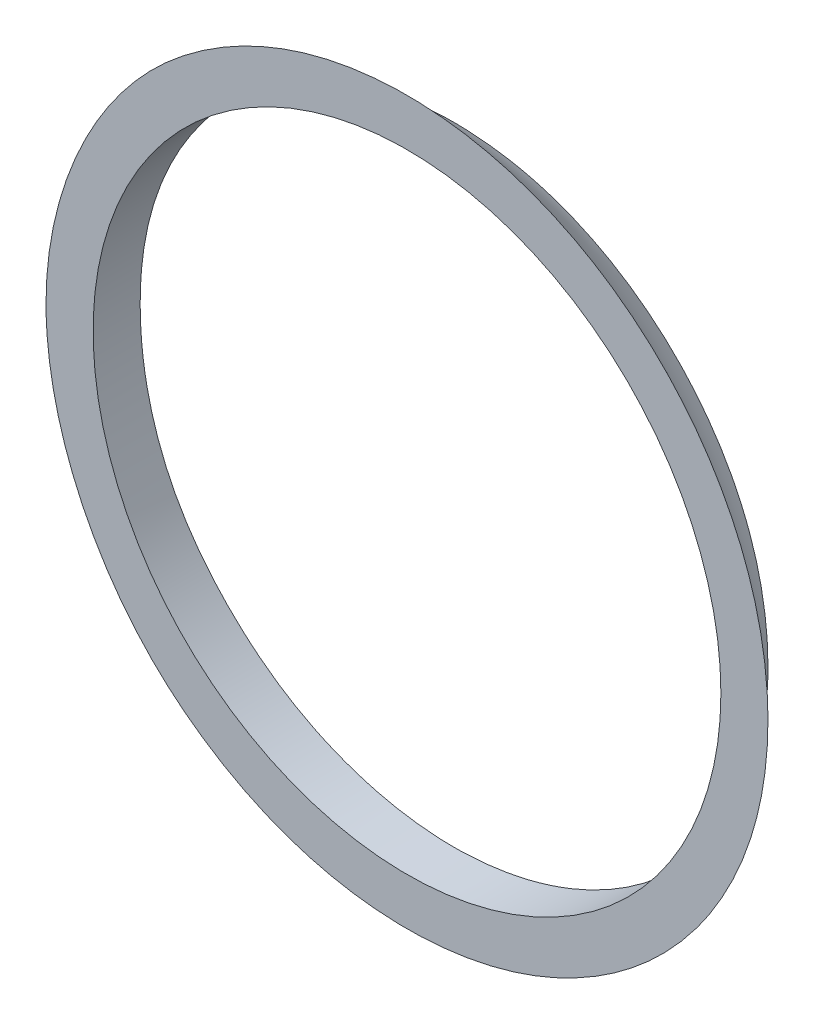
ISO-10303-21;
HEADER;
FILE_DESCRIPTION(('STEP AP214'),'2;1');
FILE_NAME('part.step','',(''),(''),'','','');
FILE_SCHEMA(('AUTOMOTIVE_DESIGN { 1 0 10303 214 1 1 1 1 }'));
ENDSEC;
DATA;
#1=APPLICATION_CONTEXT('core data for automotive mechanical design processes');
#2=APPLICATION_PROTOCOL_DEFINITION('international standard','automotive_design',2000,#1);
#3=PRODUCT_CONTEXT('',#1,'mechanical');
#4=PRODUCT('Part','Part','',(#3));
#5=PRODUCT_RELATED_PRODUCT_CATEGORY('part','',(#4));
#6=PRODUCT_DEFINITION_FORMATION('','',#4);
#7=PRODUCT_DEFINITION_CONTEXT('part definition',#1,'design');
#8=PRODUCT_DEFINITION('design','',#6,#7);
#9=PRODUCT_DEFINITION_SHAPE('','',#8);
#10=(LENGTH_UNIT() NAMED_UNIT(*) SI_UNIT(.MILLI.,.METRE.));
#11=(NAMED_UNIT(*) PLANE_ANGLE_UNIT() SI_UNIT($,.RADIAN.));
#12=(NAMED_UNIT(*) SI_UNIT($,.STERADIAN.) SOLID_ANGLE_UNIT());
#13=UNCERTAINTY_MEASURE_WITH_UNIT(LENGTH_MEASURE(1.E-05),#10,'distance_accuracy_value','');
#14=(GEOMETRIC_REPRESENTATION_CONTEXT(3) GLOBAL_UNCERTAINTY_ASSIGNED_CONTEXT((#13)) GLOBAL_UNIT_ASSIGNED_CONTEXT((#10,
#11,#12)) REPRESENTATION_CONTEXT('',''));
#15=CARTESIAN_POINT('',(0.,0.,0.));
#16=DIRECTION('',(0.,0.,1.));
#17=DIRECTION('',(1.,0.,0.));
#18=AXIS2_PLACEMENT_3D('',#15,#16,#17);
#19=CARTESIAN_POINT('',(274.208529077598,-309.466198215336,-184.999999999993));
#20=DIRECTION('',(0.,0.,1.));
#21=DIRECTION('',(-0.000437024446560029,-0.999999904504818,0.));
#22=AXIS2_PLACEMENT_3D('',#19,#20,#21);
#23=PLANE('',#22);
#24=CARTESIAN_POINT('',(301.151711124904,-439.488037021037,-184.999999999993));
#25=CARTESIAN_POINT('',(301.151703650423,-438.865242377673,-184.999999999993));
#26=CARTESIAN_POINT('',(301.179197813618,-438.242566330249,-184.999999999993));
#27=CARTESIAN_POINT('',(301.28687473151,-437.001589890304,-184.999999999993));
#28=CARTESIAN_POINT('',(301.367074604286,-436.383290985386,-184.999999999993));
#29=CARTESIAN_POINT('',(301.578055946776,-435.154078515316,-184.999999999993));
#30=CARTESIAN_POINT('',(301.70894633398,-434.543183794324,-184.999999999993));
#31=CARTESIAN_POINT('',(302.019060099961,-433.333816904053,-184.999999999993));
#32=CARTESIAN_POINT('',(302.198279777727,-432.735343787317,-184.999999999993));
#33=CARTESIAN_POINT('',(302.535109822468,-431.752433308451,-184.999999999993));
#34=CARTESIAN_POINT('',(302.679816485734,-431.363514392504,-184.999999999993));
#35=CARTESIAN_POINT('',(302.989157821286,-430.593662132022,-184.999999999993));
#36=CARTESIAN_POINT('',(303.153792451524,-430.212728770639,-184.999999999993));
#37=CARTESIAN_POINT('',(303.502498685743,-429.459868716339,-184.999999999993));
#38=CARTESIAN_POINT('',(303.686570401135,-429.087942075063,-184.999999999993));
#39=CARTESIAN_POINT('',(304.073497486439,-428.354520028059,-184.999999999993));
#40=CARTESIAN_POINT('',(304.276331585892,-427.99301340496,-184.999999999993));
#41=CARTESIAN_POINT('',(304.700560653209,-427.281051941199,-184.999999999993));
#42=CARTESIAN_POINT('',(304.921955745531,-426.930597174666,-184.999999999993));
#43=CARTESIAN_POINT('',(305.382957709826,-426.24181842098,-184.999999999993));
#44=CARTESIAN_POINT('',(305.622566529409,-425.90349573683,-184.999999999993));
#45=CARTESIAN_POINT('',(306.139840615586,-425.213220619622,-184.999999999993));
#46=CARTESIAN_POINT('',(306.419016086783,-424.86239830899,-184.999999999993));
#47=CARTESIAN_POINT('',(306.997777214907,-424.17795437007,-184.999999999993));
#48=CARTESIAN_POINT('',(307.297362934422,-423.844332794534,-184.999999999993));
#49=CARTESIAN_POINT('',(307.761612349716,-423.358210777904,-184.999999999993));
#50=CARTESIAN_POINT('',(307.918839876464,-423.198555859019,-184.999999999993));
#51=CARTESIAN_POINT('',(308.238159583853,-422.884187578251,-184.999999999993));
#52=CARTESIAN_POINT('',(308.400251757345,-422.729474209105,-184.999999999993));
#53=CARTESIAN_POINT('',(308.893672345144,-422.272760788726,-184.999999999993));
#54=CARTESIAN_POINT('',(309.232033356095,-421.978304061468,-184.999999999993));
#55=CARTESIAN_POINT('',(309.925855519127,-421.410188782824,-184.999999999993));
#56=CARTESIAN_POINT('',(310.281319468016,-421.136533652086,-184.999999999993));
#57=CARTESIAN_POINT('',(310.82597613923,-420.741972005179,-184.999999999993));
#58=CARTESIAN_POINT('',(311.009445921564,-420.613100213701,-184.999999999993));
#59=CARTESIAN_POINT('',(311.380034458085,-420.36063427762,-184.999999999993));
#60=CARTESIAN_POINT('',(311.567154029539,-420.237041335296,-184.999999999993));
#61=CARTESIAN_POINT('',(312.288617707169,-419.775213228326,-184.999999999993));
#62=CARTESIAN_POINT('',(312.835138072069,-419.455688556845,-184.999999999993));
#63=CARTESIAN_POINT('',(313.952388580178,-418.862296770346,-184.999999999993));
#64=CARTESIAN_POINT('',(314.523120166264,-418.588432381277,-184.999999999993));
#65=CARTESIAN_POINT('',(315.685130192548,-418.08908659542,-184.999999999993));
#66=CARTESIAN_POINT('',(316.276400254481,-417.863585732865,-184.999999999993));
#67=CARTESIAN_POINT('',(317.475923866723,-417.463057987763,-184.999999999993));
#68=CARTESIAN_POINT('',(318.084178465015,-417.288034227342,-184.999999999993));
#69=CARTESIAN_POINT('',(319.011476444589,-417.062840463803,-184.999999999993));
#70=CARTESIAN_POINT('',(319.325997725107,-416.993544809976,-184.999999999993));
#71=CARTESIAN_POINT('',(319.957706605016,-416.868315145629,-184.999999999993));
#72=CARTESIAN_POINT('',(320.274894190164,-416.812381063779,-184.999999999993));
#73=CARTESIAN_POINT('',(320.911319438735,-416.713741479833,-184.999999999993));
#74=CARTESIAN_POINT('',(321.230557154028,-416.671036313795,-184.999999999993));
#75=CARTESIAN_POINT('',(321.870526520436,-416.598841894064,-184.999999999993));
#76=CARTESIAN_POINT('',(322.191258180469,-416.569352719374,-184.999999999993));
#77=CARTESIAN_POINT('',(322.833781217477,-416.523648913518,-184.999999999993));
#78=CARTESIAN_POINT('',(323.155572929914,-416.507438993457,-184.999999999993));
#79=CARTESIAN_POINT('',(323.799550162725,-416.488516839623,-184.999999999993));
#80=CARTESIAN_POINT('',(324.121735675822,-416.485804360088,-184.999999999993));
#81=CARTESIAN_POINT('',(324.7659355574,-416.493986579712,-184.999999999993));
#82=CARTESIAN_POINT('',(325.087949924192,-416.504881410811,-184.999999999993));
#83=CARTESIAN_POINT('',(325.731254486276,-416.540021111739,-184.999999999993));
#84=CARTESIAN_POINT('',(326.052544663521,-416.564266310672,-184.999999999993));
#85=CARTESIAN_POINT('',(326.696978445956,-416.626316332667,-184.999999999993));
#86=CARTESIAN_POINT('',(327.020109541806,-416.664251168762,-184.999999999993));
#87=CARTESIAN_POINT('',(327.664496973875,-416.753613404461,-184.999999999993));
#88=CARTESIAN_POINT('',(327.985753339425,-416.805040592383,-184.999999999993));
#89=CARTESIAN_POINT('',(328.625777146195,-416.921499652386,-184.999999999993));
#90=CARTESIAN_POINT('',(328.944544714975,-416.98653082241,-184.999999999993));
#91=CARTESIAN_POINT('',(329.578986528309,-417.130274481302,-184.999999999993));
#92=CARTESIAN_POINT('',(329.894660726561,-417.208987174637,-184.999999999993));
#93=CARTESIAN_POINT('',(330.522212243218,-417.379937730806,-184.999999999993));
#94=CARTESIAN_POINT('',(330.834090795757,-417.472171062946,-184.999999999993));
#95=CARTESIAN_POINT('',(331.453581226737,-417.669998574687,-184.999999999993));
#96=CARTESIAN_POINT('',(331.761193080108,-417.77559283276,-184.999999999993));
#97=CARTESIAN_POINT('',(332.371585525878,-417.999874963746,-184.999999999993));
#98=CARTESIAN_POINT('',(332.674366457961,-418.118561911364,-184.999999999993));
#99=CARTESIAN_POINT('',(333.274668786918,-418.368710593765,-184.999999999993));
#100=CARTESIAN_POINT('',(333.572188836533,-418.500175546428,-184.999999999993));
#101=CARTESIAN_POINT('',(334.448983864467,-418.910037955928,-184.999999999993));
#102=CARTESIAN_POINT('',(335.019885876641,-419.206627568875,-184.999999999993));
#103=CARTESIAN_POINT('',(336.134835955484,-419.846446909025,-184.999999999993));
#104=CARTESIAN_POINT('',(336.678883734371,-420.189677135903,-184.999999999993));
#105=CARTESIAN_POINT('',(337.736528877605,-420.920580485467,-184.999999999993));
#106=CARTESIAN_POINT('',(338.250116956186,-421.308267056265,-184.999999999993));
#107=CARTESIAN_POINT('',(339.243217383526,-422.125090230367,-184.999999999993));
#108=CARTESIAN_POINT('',(339.722728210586,-422.554228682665,-184.999999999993));
#109=CARTESIAN_POINT('',(340.648626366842,-423.454866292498,-184.999999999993));
#110=CARTESIAN_POINT('',(341.094676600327,-423.926712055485,-184.999999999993));
#111=CARTESIAN_POINT('',(341.94559222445,-424.906172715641,-184.999999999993));
#112=CARTESIAN_POINT('',(342.350458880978,-425.413786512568,-184.999999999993));
#113=CARTESIAN_POINT('',(343.115801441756,-426.461193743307,-184.999999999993));
#114=CARTESIAN_POINT('',(343.476290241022,-427.000977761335,-184.999999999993));
#115=CARTESIAN_POINT('',(344.150487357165,-428.109147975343,-184.999999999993));
#116=CARTESIAN_POINT('',(344.46419328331,-428.677535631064,-184.999999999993));
#117=CARTESIAN_POINT('',(344.898076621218,-429.548664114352,-184.999999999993));
#118=CARTESIAN_POINT('',(345.036684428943,-429.842364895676,-184.999999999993));
#119=CARTESIAN_POINT('',(345.301358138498,-430.435383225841,-184.999999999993));
#120=CARTESIAN_POINT('',(345.427424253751,-430.734700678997,-184.999999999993));
#121=CARTESIAN_POINT('',(345.666682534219,-431.338410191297,-184.999999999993));
#122=CARTESIAN_POINT('',(345.779875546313,-431.642801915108,-184.999999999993));
#123=CARTESIAN_POINT('',(345.993084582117,-432.256169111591,-184.999999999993));
#124=CARTESIAN_POINT('',(346.093100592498,-432.565144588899,-184.999999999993));
#125=CARTESIAN_POINT('',(346.279740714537,-433.187172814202,-184.999999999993));
#126=CARTESIAN_POINT('',(346.366362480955,-433.500226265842,-184.999999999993));
#127=CARTESIAN_POINT('',(346.526046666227,-434.129810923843,-184.999999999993));
#128=CARTESIAN_POINT('',(346.59910752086,-434.446342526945,-184.999999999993));
#129=CARTESIAN_POINT('',(346.731585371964,-435.082263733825,-184.999999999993));
#130=CARTESIAN_POINT('',(346.791001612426,-435.401653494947,-184.999999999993));
#131=CARTESIAN_POINT('',(346.896327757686,-436.04261425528,-184.999999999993));
#132=CARTESIAN_POINT('',(346.942239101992,-436.364185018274,-184.999999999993));
#133=CARTESIAN_POINT('',(347.020153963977,-437.005182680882,-184.999999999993));
#134=CARTESIAN_POINT('',(347.052314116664,-437.324590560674,-184.999999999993));
#135=CARTESIAN_POINT('',(347.103450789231,-437.964455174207,-184.999999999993));
#136=CARTESIAN_POINT('',(347.122427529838,-438.284911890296,-184.999999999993));
#137=CARTESIAN_POINT('',(347.147047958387,-438.9263368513,-184.999999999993));
#138=CARTESIAN_POINT('',(347.152691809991,-439.247305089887,-184.999999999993));
#139=CARTESIAN_POINT('',(347.150448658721,-439.889192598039,-184.999999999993));
#140=CARTESIAN_POINT('',(347.142561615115,-440.210111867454,-184.999999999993));
#141=CARTESIAN_POINT('',(347.113498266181,-440.851302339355,-184.999999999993));
#142=CARTESIAN_POINT('',(347.092324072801,-441.17157363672,-184.999999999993));
#143=CARTESIAN_POINT('',(347.036811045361,-441.810944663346,-184.999999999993));
#144=CARTESIAN_POINT('',(347.002472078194,-442.130044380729,-184.999999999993));
#145=CARTESIAN_POINT('',(346.879764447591,-443.084840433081,-184.999999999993));
#146=CARTESIAN_POINT('',(346.771698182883,-443.718184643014,-184.999999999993));
#147=CARTESIAN_POINT('',(346.56862796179,-444.664393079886,-184.999999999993));
#148=CARTESIAN_POINT('',(346.493348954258,-444.981647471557,-184.999999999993));
#149=CARTESIAN_POINT('',(346.329138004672,-445.6125954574,-184.999999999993));
#150=CARTESIAN_POINT('',(346.240207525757,-445.926289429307,-184.999999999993));
#151=CARTESIAN_POINT('',(346.048853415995,-446.549560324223,-184.999999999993));
#152=CARTESIAN_POINT('',(345.946428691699,-446.859136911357,-184.999999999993));
#153=CARTESIAN_POINT('',(345.728342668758,-447.473569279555,-184.999999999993));
#154=CARTESIAN_POINT('',(345.612681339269,-447.778425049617,-184.999999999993));
#155=CARTESIAN_POINT('',(345.246346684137,-448.685146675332,-184.999999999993));
#156=CARTESIAN_POINT('',(344.97627871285,-449.27930965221,-184.999999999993));
#157=CARTESIAN_POINT('',(344.386802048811,-450.442522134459,-184.999999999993));
#158=CARTESIAN_POINT('',(344.067393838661,-451.011571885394,-184.999999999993));
#159=CARTESIAN_POINT('',(343.386808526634,-452.111844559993,-184.999999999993));
#160=CARTESIAN_POINT('',(343.026364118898,-452.643520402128,-184.999999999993));
#161=CARTESIAN_POINT('',(342.26237907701,-453.67493011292,-184.999999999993));
#162=CARTESIAN_POINT('',(341.858838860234,-454.174664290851,-184.999999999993));
#163=CARTESIAN_POINT('',(341.011619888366,-455.138964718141,-184.999999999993));
#164=CARTESIAN_POINT('',(340.567936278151,-455.603526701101,-184.999999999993));
#165=CARTESIAN_POINT('',(339.643599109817,-456.494281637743,-184.999999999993));
#166=CARTESIAN_POINT('',(339.162945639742,-456.920474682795,-184.999999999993));
#167=CARTESIAN_POINT('',(338.161360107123,-457.736674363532,-184.999999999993));
#168=CARTESIAN_POINT('',(337.639985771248,-458.126138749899,-184.999999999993));
#169=CARTESIAN_POINT('',(336.566138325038,-458.859535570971,-184.999999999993));
#170=CARTESIAN_POINT('',(336.013663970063,-459.203466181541,-184.999999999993));
#171=CARTESIAN_POINT('',(334.88166943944,-459.843345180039,-184.999999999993));
#172=CARTESIAN_POINT('',(334.302155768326,-460.139305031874,-184.999999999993));
#173=CARTESIAN_POINT('',(333.415849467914,-460.545603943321,-184.999999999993));
#174=CARTESIAN_POINT('',(333.11755071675,-460.674772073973,-184.999999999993));
#175=CARTESIAN_POINT('',(332.51570200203,-460.92031817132,-184.999999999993));
#176=CARTESIAN_POINT('',(332.21215193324,-461.036695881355,-184.999999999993));
#177=CARTESIAN_POINT('',(331.601813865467,-461.255779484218,-184.999999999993));
#178=CARTESIAN_POINT('',(331.295048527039,-461.358548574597,-184.999999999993));
#179=CARTESIAN_POINT('',(330.677418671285,-461.550820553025,-184.999999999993));
#180=CARTESIAN_POINT('',(330.366554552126,-461.640324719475,-184.999999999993));
#181=CARTESIAN_POINT('',(329.741244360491,-461.80591659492,-184.999999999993));
#182=CARTESIAN_POINT('',(329.426797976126,-461.882003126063,-184.999999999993));
#183=CARTESIAN_POINT('',(328.794936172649,-462.020640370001,-184.999999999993));
#184=CARTESIAN_POINT('',(328.477520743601,-462.083191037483,-184.999999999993));
#185=CARTESIAN_POINT('',(327.840285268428,-462.194873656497,-184.999999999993));
#186=CARTESIAN_POINT('',(327.520464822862,-462.244003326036,-184.999999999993));
#187=CARTESIAN_POINT('',(326.879057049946,-462.328919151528,-184.999999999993));
#188=CARTESIAN_POINT('',(326.557469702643,-462.364705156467,-184.999999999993));
#189=CARTESIAN_POINT('',(325.913083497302,-462.422896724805,-184.999999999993));
#190=CARTESIAN_POINT('',(325.59028465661,-462.445302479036,-184.999999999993));
#191=CARTESIAN_POINT('',(324.944066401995,-462.476623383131,-184.999999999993));
#192=CARTESIAN_POINT('',(324.620647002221,-462.48553883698,-184.999999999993));
#193=CARTESIAN_POINT('',(323.652302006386,-462.491643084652,-184.999999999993));
#194=CARTESIAN_POINT('',(323.007084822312,-462.468391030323,-184.999999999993));
#195=CARTESIAN_POINT('',(322.042624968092,-462.393618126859,-184.999999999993));
#196=CARTESIAN_POINT('',(321.721657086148,-462.362037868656,-184.999999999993));
#197=CARTESIAN_POINT('',(321.08127290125,-462.285627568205,-184.999999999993));
#198=CARTESIAN_POINT('',(320.761856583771,-462.240797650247,-184.999999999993));
#199=CARTESIAN_POINT('',(320.125169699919,-462.137855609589,-184.999999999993));
#200=CARTESIAN_POINT('',(319.80789918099,-462.079743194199,-184.999999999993));
#201=CARTESIAN_POINT('',(319.176105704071,-461.950091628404,-184.999999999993));
#202=CARTESIAN_POINT('',(318.86158277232,-461.878552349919,-184.999999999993));
#203=CARTESIAN_POINT('',(318.235927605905,-461.722091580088,-184.999999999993));
#204=CARTESIAN_POINT('',(317.924794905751,-461.637171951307,-184.999999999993));
#205=CARTESIAN_POINT('',(317.306454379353,-461.454067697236,-184.999999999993));
#206=CARTESIAN_POINT('',(316.999246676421,-461.355882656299,-184.999999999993));
#207=CARTESIAN_POINT('',(316.287276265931,-461.11139818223,-184.999999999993));
#208=CARTESIAN_POINT('',(315.884256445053,-460.959990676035,-184.999999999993));
#209=CARTESIAN_POINT('',(315.087426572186,-460.634556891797,-184.999999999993));
#210=CARTESIAN_POINT('',(314.69361744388,-460.460528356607,-184.999999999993));
#211=CARTESIAN_POINT('',(313.91633017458,-460.090673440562,-184.999999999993));
#212=CARTESIAN_POINT('',(313.532853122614,-459.894844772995,-184.999999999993));
#213=CARTESIAN_POINT('',(312.777456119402,-459.482286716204,-184.999999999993));
#214=CARTESIAN_POINT('',(312.405532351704,-459.265564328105,-184.999999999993));
#215=CARTESIAN_POINT('',(311.857061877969,-458.925415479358,-184.999999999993));
#216=CARTESIAN_POINT('',(311.675804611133,-458.809519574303,-184.999999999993));
#217=CARTESIAN_POINT('',(311.316531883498,-458.572807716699,-184.999999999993));
#218=CARTESIAN_POINT('',(311.138516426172,-458.451991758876,-184.999999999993));
#219=CARTESIAN_POINT('',(310.609609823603,-458.082231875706,-184.999999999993));
#220=CARTESIAN_POINT('',(310.263806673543,-457.825943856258,-184.999999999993));
#221=CARTESIAN_POINT('',(309.585145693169,-457.292278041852,-184.999999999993));
#222=CARTESIAN_POINT('',(309.252389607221,-457.014770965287,-184.999999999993));
#223=CARTESIAN_POINT('',(308.603760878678,-456.440667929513,-184.999999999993));
#224=CARTESIAN_POINT('',(308.287887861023,-456.144072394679,-184.999999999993));
#225=CARTESIAN_POINT('',(307.674483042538,-455.53251847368,-184.999999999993));
#226=CARTESIAN_POINT('',(307.376950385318,-455.217560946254,-184.999999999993));
#227=CARTESIAN_POINT('',(306.800675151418,-454.570783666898,-184.999999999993));
#228=CARTESIAN_POINT('',(306.521937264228,-454.238959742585,-184.999999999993));
#229=CARTESIAN_POINT('',(305.983710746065,-453.559994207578,-184.999999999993));
#230=CARTESIAN_POINT('',(305.724224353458,-453.212850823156,-184.999999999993));
#231=CARTESIAN_POINT('',(305.224959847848,-452.504696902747,-184.999999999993));
#232=CARTESIAN_POINT('',(304.985182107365,-452.143686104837,-184.999999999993));
#233=CARTESIAN_POINT('',(304.419866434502,-451.239803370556,-184.999999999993));
#234=CARTESIAN_POINT('',(304.105704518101,-450.689764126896,-184.999999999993));
#235=CARTESIAN_POINT('',(303.521742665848,-449.566711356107,-184.999999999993));
#236=CARTESIAN_POINT('',(303.251941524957,-448.993698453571,-184.999999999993));
#237=CARTESIAN_POINT('',(302.758387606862,-447.828477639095,-184.999999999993));
#238=CARTESIAN_POINT('',(302.534611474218,-447.236279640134,-184.999999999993));
#239=CARTESIAN_POINT('',(302.134874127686,-446.036138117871,-184.999999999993));
#240=CARTESIAN_POINT('',(301.958903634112,-445.42819767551,-184.999999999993));
#241=CARTESIAN_POINT('',(301.593670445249,-443.943167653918,-184.999999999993));
#242=CARTESIAN_POINT('',(301.429568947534,-443.059743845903,-184.999999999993));
#243=CARTESIAN_POINT('',(301.208645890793,-441.280135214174,-184.999999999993));
#244=CARTESIAN_POINT('',(301.15172187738,-440.383963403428,-184.999999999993));
#245=CARTESIAN_POINT('',(301.151711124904,-439.488037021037,-184.999999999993));
#246=B_SPLINE_CURVE_WITH_KNOTS('',3,(#24,#25,#26,#27,#28,#29,#30,#31,#32,#33,#34,#35,#36,#37,
#38,#39,#40,#41,#42,#43,#44,#45,#46,#47,#48,#49,#50,#51,#52,#53,#54,#55,#56,#57,#58,#59,#60,#61,
#62,#63,#64,#65,#66,#67,#68,#69,#70,#71,#72,#73,#74,#75,#76,#77,#78,#79,#80,#81,#82,#83,#84,#85,
#86,#87,#88,#89,#90,#91,#92,#93,#94,#95,#96,#97,#98,#99,#100,#101,#102,#103,#104,#105,#106,#107,
#108,#109,#110,#111,#112,#113,#114,#115,#116,#117,#118,#119,#120,#121,#122,#123,#124,#125,#126,
#127,#128,#129,#130,#131,#132,#133,#134,#135,#136,#137,#138,#139,#140,#141,#142,#143,#144,#145,
#146,#147,#148,#149,#150,#151,#152,#153,#154,#155,#156,#157,#158,#159,#160,#161,#162,#163,#164,
#165,#166,#167,#168,#169,#170,#171,#172,#173,#174,#175,#176,#177,#178,#179,#180,#181,#182,#183,
#184,#185,#186,#187,#188,#189,#190,#191,#192,#193,#194,#195,#196,#197,#198,#199,#200,#201,#202,
#203,#204,#205,#206,#207,#208,#209,#210,#211,#212,#213,#214,#215,#216,#217,#218,#219,#220,#221,
#222,#223,#224,#225,#226,#227,#228,#229,#230,#231,#232,#233,#234,#235,#236,#237,#238,#239,#240,
#241,#242,#243,#244,#245),.UNSPECIFIED.,.T.,.F.,(4,2,2,2,2,2,2,2,2,2,2,2,2,2,2,2,2,2,2,2,2,2,2,
2,2,2,2,2,2,2,2,2,2,2,2,2,2,2,2,2,2,2,2,2,2,2,2,2,2,2,2,2,2,2,2,2,2,2,2,2,2,2,2,2,2,2,2,2,2,2,2,
2,2,2,2,2,2,2,2,2,2,2,2,2,2,2,2,2,2,2,2,2,2,2,2,2,2,2,2,2,2,2,2,2,2,2,2,2,2,2,4),(0.,
1.86762920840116,3.73586529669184,5.60813809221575,7.4802675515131,8.7246655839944,
9.96906099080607,11.2134635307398,12.4564722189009,13.6994892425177,14.942639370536,
16.2869180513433,17.6312008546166,18.3033361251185,18.9754704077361,20.3202221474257,
21.665194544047,22.3377335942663,23.0104250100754,24.9073292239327,26.8043466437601,
28.7005990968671,30.5969688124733,31.5629220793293,32.5288701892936,33.4948428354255,
34.4608212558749,35.4271422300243,36.3934456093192,37.3597583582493,38.3260949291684,
39.3018615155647,40.2776127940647,41.2533137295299,42.2290292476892,43.2044185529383,
44.1798135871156,45.1551397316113,46.1307121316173,48.0582973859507,49.9859032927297,
51.914093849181,53.8423704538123,55.7880081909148,57.7335861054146,59.6785973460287,
61.6237079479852,62.5977653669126,63.5718062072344,64.5457829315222,65.5197606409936,
66.4939086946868,67.4681690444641,68.4424833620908,69.4166937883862,70.3794909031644,
71.3422718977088,72.305041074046,73.2678131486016,74.2304322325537,75.1930610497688,
77.1178665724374,78.0958194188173,79.0736675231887,80.0515949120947,81.0295245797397,
82.9849371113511,84.9403305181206,86.8650925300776,88.7898359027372,90.7148123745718,
92.6397842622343,94.5897726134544,96.5398390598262,98.4894387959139,99.4643913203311,
100.439363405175,101.409635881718,102.379814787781,103.350078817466,104.320346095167,
105.29077824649,106.261221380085,107.231650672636,108.20205809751,110.13625154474,
111.103604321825,112.070948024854,113.03831304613,114.005687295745,114.972927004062,
115.94019702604,117.231032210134,118.521996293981,119.813095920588,121.103764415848,
121.749120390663,122.394477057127,123.685007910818,124.984147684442,126.283258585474,
127.582308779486,128.881681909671,130.181205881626,131.480754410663,133.378949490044,
135.277092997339,137.174270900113,139.071080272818,141.760345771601,144.447039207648),.UNSPECIFIED.);
#247=CARTESIAN_POINT('',(301.151711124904,-439.488037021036,-184.999999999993));
#248=VERTEX_POINT('',#247);
#249=EDGE_CURVE('E61',#248,#248,#246,.T.);
#250=ORIENTED_EDGE('',*,*,#249,.F.);
#251=EDGE_LOOP('',(#250));
#252=FACE_BOUND('',#251,.T.);
#253=CARTESIAN_POINT('',(324.15171112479,-439.48803702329,-184.999999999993));
#254=DIRECTION('',(0.,0.,1.));
#255=DIRECTION('',(1.,0.,0.));
#256=AXIS2_PLACEMENT_3D('',#253,#254,#255);
#257=CIRCLE('',#256,20.);
#258=CARTESIAN_POINT('',(344.15171112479,-439.48803702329,-184.999999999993));
#259=VERTEX_POINT('',#258);
#260=EDGE_CURVE('E71',#259,#259,#257,.T.);
#261=ORIENTED_EDGE('',*,*,#260,.F.);
#262=EDGE_LOOP('',(#261));
#263=FACE_BOUND('',#262,.T.);
#264=ADVANCED_FACE('F54',(#252,#263),#23,.T.);
#265=CARTESIAN_POINT('',(324.15171112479,-439.48803702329,-152.499999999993));
#266=DIRECTION('',(0.,0.,-1.));
#267=DIRECTION('',(0.000437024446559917,0.999999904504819,0.));
#268=AXIS2_PLACEMENT_3D('',#265,#266,#267);
#269=CYLINDRICAL_SURFACE('',#268,20.);
#270=ORIENTED_EDGE('',*,*,#260,.T.);
#271=EDGE_LOOP('',(#270));
#272=FACE_BOUND('',#271,.T.);
#273=CARTESIAN_POINT('',(304.15171112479,-439.488037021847,-188.00000000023));
#274=CARTESIAN_POINT('',(304.15171486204,-440.048969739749,-188.000001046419));
#275=CARTESIAN_POINT('',(304.175330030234,-440.610006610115,-187.996684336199));
#276=CARTESIAN_POINT('',(304.269639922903,-441.728176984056,-187.986761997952));
#277=CARTESIAN_POINT('',(304.340347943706,-442.285309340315,-187.980155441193));
#278=CARTESIAN_POINT('',(304.528447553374,-443.392272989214,-187.966517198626));
#279=CARTESIAN_POINT('',(304.645891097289,-443.942095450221,-187.959485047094));
#280=CARTESIAN_POINT('',(304.926651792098,-445.029926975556,-187.947181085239));
#281=CARTESIAN_POINT('',(305.089965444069,-445.567936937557,-187.941909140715));
#282=CARTESIAN_POINT('',(305.399410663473,-446.45163358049,-187.935716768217));
#283=CARTESIAN_POINT('',(305.533155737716,-446.80170735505,-187.933931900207));
#284=CARTESIAN_POINT('',(305.820108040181,-447.493824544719,-187.931934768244));
#285=CARTESIAN_POINT('',(305.973315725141,-447.835867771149,-187.931722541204));
#286=CARTESIAN_POINT('',(306.298696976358,-448.510799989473,-187.932906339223));
#287=CARTESIAN_POINT('',(306.470870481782,-448.843689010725,-187.934302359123));
#288=CARTESIAN_POINT('',(306.833599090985,-449.499194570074,-187.938559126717));
#289=CARTESIAN_POINT('',(307.024150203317,-449.821813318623,-187.941419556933));
#290=CARTESIAN_POINT('',(307.423061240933,-450.455833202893,-187.948283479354));
#291=CARTESIAN_POINT('',(307.631421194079,-450.767234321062,-187.952286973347));
#292=CARTESIAN_POINT('',(308.06529368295,-451.377841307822,-187.960928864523));
#293=CARTESIAN_POINT('',(308.290806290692,-451.6770471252,-187.965567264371));
#294=CARTESIAN_POINT('',(308.758083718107,-452.262083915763,-187.974774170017));
#295=CARTESIAN_POINT('',(308.999834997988,-452.547925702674,-187.97934273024));
#296=CARTESIAN_POINT('',(309.49899959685,-453.105602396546,-187.987525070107));
#297=CARTESIAN_POINT('',(309.756412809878,-453.377437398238,-187.991138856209));
#298=CARTESIAN_POINT('',(310.286094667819,-453.906245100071,-187.996329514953));
#299=CARTESIAN_POINT('',(310.558363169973,-454.163217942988,-187.997906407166));
#300=CARTESIAN_POINT('',(311.116893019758,-454.661487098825,-187.99957066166));
#301=CARTESIAN_POINT('',(311.403154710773,-454.902783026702,-187.999657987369));
#302=CARTESIAN_POINT('',(311.988785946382,-455.368947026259,-187.99914649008));
#303=CARTESIAN_POINT('',(312.288155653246,-455.593814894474,-187.998547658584));
#304=CARTESIAN_POINT('',(312.74628283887,-455.91822974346,-187.997900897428));
#305=CARTESIAN_POINT('',(312.900510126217,-456.0242240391,-187.997727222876));
#306=CARTESIAN_POINT('',(313.211880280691,-456.231845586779,-187.997582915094));
#307=CARTESIAN_POINT('',(313.369023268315,-456.333472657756,-187.997612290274));
#308=CARTESIAN_POINT('',(314.003538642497,-456.731298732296,-187.998076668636));
#309=CARTESIAN_POINT('',(314.492226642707,-457.009740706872,-187.999205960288));
#310=CARTESIAN_POINT('',(315.491289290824,-457.524469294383,-188.002113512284));
#311=CARTESIAN_POINT('',(316.001663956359,-457.760755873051,-188.003891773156));
#312=CARTESIAN_POINT('',(316.780672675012,-458.082304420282,-188.006010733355));
#313=CARTESIAN_POINT('',(317.042613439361,-458.184016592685,-188.006625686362));
#314=CARTESIAN_POINT('',(317.570547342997,-458.376319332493,-188.007530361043));
#315=CARTESIAN_POINT('',(317.836540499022,-458.466909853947,-188.007820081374));
#316=CARTESIAN_POINT('',(318.639862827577,-458.721732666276,-188.008085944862));
#317=CARTESIAN_POINT('',(319.182651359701,-458.869064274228,-188.007459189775));
#318=CARTESIAN_POINT('',(320.279033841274,-459.117568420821,-188.005003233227));
#319=CARTESIAN_POINT('',(320.832634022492,-459.2187134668,-188.003173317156));
#320=CARTESIAN_POINT('',(321.667815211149,-459.335186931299,-188.001275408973));
#321=CARTESIAN_POINT('',(321.947037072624,-459.368139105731,-188.000783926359));
#322=CARTESIAN_POINT('',(322.506639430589,-459.422247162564,-188.000125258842));
#323=CARTESIAN_POINT('',(322.787019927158,-459.443403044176,-187.999958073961));
#324=CARTESIAN_POINT('',(323.348418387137,-459.473875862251,-187.999869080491));
#325=CARTESIAN_POINT('',(323.62943634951,-459.48319281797,-187.999947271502));
#326=CARTESIAN_POINT('',(324.191616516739,-459.489972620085,-187.999998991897));
#327=CARTESIAN_POINT('',(324.472778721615,-459.487435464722,-187.999972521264));
#328=CARTESIAN_POINT('',(325.034746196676,-459.470511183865,-187.999969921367));
#329=CARTESIAN_POINT('',(325.315551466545,-459.456124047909,-187.999993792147));
#330=CARTESIAN_POINT('',(325.876305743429,-459.41552548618,-188.000332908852));
#331=CARTESIAN_POINT('',(326.156254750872,-459.389314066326,-188.000648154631));
#332=CARTESIAN_POINT('',(326.714809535,-459.325112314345,-188.001581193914));
#333=CARTESIAN_POINT('',(326.993415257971,-459.287121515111,-188.002198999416));
#334=CARTESIAN_POINT('',(327.54877721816,-459.199428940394,-188.003601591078));
#335=CARTESIAN_POINT('',(327.825533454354,-459.149727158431,-188.00438637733));
#336=CARTESIAN_POINT('',(328.37670476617,-459.038700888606,-188.005759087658));
#337=CARTESIAN_POINT('',(328.651119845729,-458.977376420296,-188.006347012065));
#338=CARTESIAN_POINT('',(329.197121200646,-458.843213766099,-188.007186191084));
#339=CARTESIAN_POINT('',(329.46870747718,-458.770375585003,-188.007437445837));
#340=CARTESIAN_POINT('',(330.008568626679,-458.613314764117,-188.007588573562));
#341=CARTESIAN_POINT('',(330.276843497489,-458.52909211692,-188.007488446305));
#342=CARTESIAN_POINT('',(330.809602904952,-458.349413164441,-188.006985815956));
#343=CARTESIAN_POINT('',(331.074087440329,-458.253956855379,-188.006583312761));
#344=CARTESIAN_POINT('',(331.598801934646,-458.051976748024,-188.00561554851));
#345=CARTESIAN_POINT('',(331.859031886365,-457.945452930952,-188.005050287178));
#346=CARTESIAN_POINT('',(332.374753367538,-457.721540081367,-188.003920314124));
#347=CARTESIAN_POINT('',(332.630244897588,-457.604151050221,-188.003355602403));
#348=CARTESIAN_POINT('',(333.388938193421,-457.235980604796,-188.001695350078));
#349=CARTESIAN_POINT('',(333.884473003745,-456.969151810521,-188.000633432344));
#350=CARTESIAN_POINT('',(334.851235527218,-456.394735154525,-187.998634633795));
#351=CARTESIAN_POINT('',(335.32246325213,-456.087147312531,-187.997697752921));
#352=CARTESIAN_POINT('',(336.237351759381,-455.433360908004,-187.995925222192));
#353=CARTESIAN_POINT('',(336.681012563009,-455.087162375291,-187.995089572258));
#354=CARTESIAN_POINT('',(337.537590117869,-454.358624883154,-187.993922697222));
#355=CARTESIAN_POINT('',(337.950506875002,-453.976285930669,-187.993591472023));
#356=CARTESIAN_POINT('',(338.74268336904,-453.178167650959,-187.993650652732));
#357=CARTESIAN_POINT('',(339.121941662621,-452.762386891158,-187.994041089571));
#358=CARTESIAN_POINT('',(339.844085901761,-451.900349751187,-187.995292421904));
#359=CARTESIAN_POINT('',(340.186971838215,-451.45409336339,-187.996153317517));
#360=CARTESIAN_POINT('',(340.833924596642,-450.534300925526,-187.997952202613));
#361=CARTESIAN_POINT('',(341.137991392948,-450.060764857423,-187.998890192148));
#362=CARTESIAN_POINT('',(341.705181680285,-449.089689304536,-188.000904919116));
#363=CARTESIAN_POINT('',(341.968305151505,-448.592149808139,-188.001981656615));
#364=CARTESIAN_POINT('',(342.330801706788,-447.830686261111,-188.003655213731));
#365=CARTESIAN_POINT('',(342.446280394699,-447.574309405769,-188.004222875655));
#366=CARTESIAN_POINT('',(342.666336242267,-447.056898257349,-188.005344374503));
#367=CARTESIAN_POINT('',(342.77091340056,-446.795863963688,-188.005898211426));
#368=CARTESIAN_POINT('',(342.968967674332,-446.269622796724,-188.006808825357));
#369=CARTESIAN_POINT('',(343.062444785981,-446.004415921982,-188.007165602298));
#370=CARTESIAN_POINT('',(343.238135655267,-445.470296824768,-188.007561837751));
#371=CARTESIAN_POINT('',(343.320349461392,-445.201384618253,-188.007601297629));
#372=CARTESIAN_POINT('',(343.473367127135,-444.660333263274,-188.007327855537));
#373=CARTESIAN_POINT('',(343.544170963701,-444.388194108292,-188.007014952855));
#374=CARTESIAN_POINT('',(343.674242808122,-443.841173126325,-188.006054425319));
#375=CARTESIAN_POINT('',(343.733510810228,-443.566291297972,-188.0054068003));
#376=CARTESIAN_POINT('',(343.840405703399,-443.014273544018,-188.003976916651));
#377=CARTESIAN_POINT('',(343.888032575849,-442.737137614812,-188.003194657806));
#378=CARTESIAN_POINT('',(343.97156053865,-442.181103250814,-188.001838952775));
#379=CARTESIAN_POINT('',(344.007461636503,-441.902204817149,-188.001265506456));
#380=CARTESIAN_POINT('',(344.067472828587,-441.343156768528,-188.000434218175));
#381=CARTESIAN_POINT('',(344.091583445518,-441.063007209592,-188.000176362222));
#382=CARTESIAN_POINT('',(344.127973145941,-440.501931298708,-187.999925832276));
#383=CARTESIAN_POINT('',(344.140252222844,-440.221004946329,-187.999933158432));
#384=CARTESIAN_POINT('',(344.149780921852,-439.799432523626,-187.999977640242));
#385=CARTESIAN_POINT('',(344.151475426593,-439.658874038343,-187.999998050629));
#386=CARTESIAN_POINT('',(344.15190099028,-439.377752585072,-188.000001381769));
#387=CARTESIAN_POINT('',(344.150632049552,-439.237189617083,-187.999984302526));
#388=CARTESIAN_POINT('',(344.142379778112,-438.815590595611,-187.999939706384));
#389=CARTESIAN_POINT('',(344.13095135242,-438.534628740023,-187.999918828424));
#390=CARTESIAN_POINT('',(344.096260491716,-437.973445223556,-188.000133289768));
#391=CARTESIAN_POINT('',(344.07299805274,-437.693223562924,-188.000368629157));
#392=CARTESIAN_POINT('',(344.01468139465,-437.13400977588,-188.001156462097));
#393=CARTESIAN_POINT('',(343.979627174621,-436.855017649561,-188.001708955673));
#394=CARTESIAN_POINT('',(343.89778643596,-436.298753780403,-188.003036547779));
#395=CARTESIAN_POINT('',(343.850999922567,-436.021482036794,-188.003811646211));
#396=CARTESIAN_POINT('',(343.745788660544,-435.469182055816,-188.00525792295));
#397=CARTESIAN_POINT('',(343.687363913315,-435.194153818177,-188.00592910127));
#398=CARTESIAN_POINT('',(343.494754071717,-434.373107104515,-188.007430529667));
#399=CARTESIAN_POINT('',(343.343215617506,-433.831005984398,-188.007749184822));
#400=CARTESIAN_POINT('',(343.082139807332,-433.02908778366,-188.00723159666));
#401=CARTESIAN_POINT('',(342.989474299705,-432.763624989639,-188.006893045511));
#402=CARTESIAN_POINT('',(342.793037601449,-432.236833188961,-188.006007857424));
#403=CARTESIAN_POINT('',(342.689266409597,-431.97550418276,-188.005461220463));
#404=CARTESIAN_POINT('',(342.361564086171,-431.198454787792,-188.003791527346));
#405=CARTESIAN_POINT('',(342.121205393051,-430.689552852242,-188.002638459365));
#406=CARTESIAN_POINT('',(341.598503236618,-429.693870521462,-188.000496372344));
#407=CARTESIAN_POINT('',(341.316159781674,-429.207090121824,-187.999507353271));
#408=CARTESIAN_POINT('',(340.711471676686,-428.259039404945,-187.997584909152));
#409=CARTESIAN_POINT('',(340.389128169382,-427.797768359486,-187.996651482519));
#410=CARTESIAN_POINT('',(339.706733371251,-426.904022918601,-187.995027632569));
#411=CARTESIAN_POINT('',(339.346682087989,-426.471548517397,-187.994337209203));
#412=CARTESIAN_POINT('',(338.591428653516,-425.638464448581,-187.993586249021));
#413=CARTESIAN_POINT('',(338.196226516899,-425.237854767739,-187.993525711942));
#414=CARTESIAN_POINT('',(337.373481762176,-424.47134985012,-187.994075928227));
#415=CARTESIAN_POINT('',(336.945939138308,-424.105454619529,-187.99468668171));
#416=CARTESIAN_POINT('',(336.061535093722,-423.410965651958,-187.996221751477));
#417=CARTESIAN_POINT('',(335.604672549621,-423.082373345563,-187.997146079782));
#418=CARTESIAN_POINT('',(334.6648925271,-422.464842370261,-187.999039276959));
#419=CARTESIAN_POINT('',(334.181975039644,-422.175903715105,-188.000008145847));
#420=CARTESIAN_POINT('',(333.193512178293,-421.639733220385,-188.002102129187));
#421=CARTESIAN_POINT('',(332.687966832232,-421.392501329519,-188.003227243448));
#422=CARTESIAN_POINT('',(331.657867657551,-420.941506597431,-188.005499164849));
#423=CARTESIAN_POINT('',(331.133313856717,-420.737743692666,-188.006645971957));
#424=CARTESIAN_POINT('',(330.068806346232,-420.375108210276,-188.007714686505));
#425=CARTESIAN_POINT('',(329.52885200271,-420.216237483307,-188.007636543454));
#426=CARTESIAN_POINT('',(328.710475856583,-420.012493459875,-188.006463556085));
#427=CARTESIAN_POINT('',(328.436245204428,-419.950334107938,-188.005896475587));
#428=CARTESIAN_POINT('',(327.885389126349,-419.837625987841,-188.004546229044));
#429=CARTESIAN_POINT('',(327.608763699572,-419.787077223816,-188.003763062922));
#430=CARTESIAN_POINT('',(327.053631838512,-419.697688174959,-188.002342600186));
#431=CARTESIAN_POINT('',(326.775125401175,-419.658847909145,-188.00170530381));
#432=CARTESIAN_POINT('',(326.216720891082,-419.592942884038,-188.000730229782));
#433=CARTESIAN_POINT('',(325.936822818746,-419.565878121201,-188.00039245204));
#434=CARTESIAN_POINT('',(325.37613499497,-419.52357290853,-188.000012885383));
#435=CARTESIAN_POINT('',(325.095345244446,-419.508332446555,-187.999971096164));
#436=CARTESIAN_POINT('',(324.533372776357,-419.489702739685,-187.999967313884));
#437=CARTESIAN_POINT('',(324.252190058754,-419.486313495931,-188.00000532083));
#438=CARTESIAN_POINT('',(323.689944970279,-419.491392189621,-187.9999589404));
#439=CARTESIAN_POINT('',(323.408882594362,-419.499859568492,-187.999874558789));
#440=CARTESIAN_POINT('',(322.847364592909,-419.528635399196,-187.999934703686));
#441=CARTESIAN_POINT('',(322.566908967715,-419.548943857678,-188.000079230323));
#442=CARTESIAN_POINT('',(322.007102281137,-419.601365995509,-188.000693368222));
#443=CARTESIAN_POINT('',(321.727751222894,-419.633479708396,-188.001162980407));
#444=CARTESIAN_POINT('',(321.17065457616,-419.709454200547,-188.002386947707));
#445=CARTESIAN_POINT('',(320.89290898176,-419.753314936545,-188.003141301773));
#446=CARTESIAN_POINT('',(320.339507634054,-419.85270857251,-188.004676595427));
#447=CARTESIAN_POINT('',(320.063851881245,-419.908241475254,-188.005457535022));
#448=CARTESIAN_POINT('',(319.515144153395,-420.030870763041,-188.00673786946));
#449=CARTESIAN_POINT('',(319.242092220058,-420.097967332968,-188.0072372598));
#450=CARTESIAN_POINT('',(318.427542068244,-420.316450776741,-188.008163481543));
#451=CARTESIAN_POINT('',(317.890520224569,-420.485054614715,-188.008018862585));
#452=CARTESIAN_POINT('',(317.009081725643,-420.80318929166,-188.006603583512));
#453=CARTESIAN_POINT('',(316.660114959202,-420.940353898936,-188.005724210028));
#454=CARTESIAN_POINT('',(315.970405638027,-421.234087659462,-188.003723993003));
#455=CARTESIAN_POINT('',(315.629663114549,-421.390656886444,-188.002603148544));
#456=CARTESIAN_POINT('',(314.95752966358,-421.722689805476,-188.000531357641));
#457=CARTESIAN_POINT('',(314.62613869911,-421.898153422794,-187.999580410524));
#458=CARTESIAN_POINT('',(313.973734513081,-422.267431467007,-187.998172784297));
#459=CARTESIAN_POINT('',(313.652720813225,-422.461245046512,-187.997716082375));
#460=CARTESIAN_POINT('',(313.179783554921,-422.765239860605,-187.997591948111));
#461=CARTESIAN_POINT('',(313.023560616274,-422.868789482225,-187.997644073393));
#462=CARTESIAN_POINT('',(312.714086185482,-423.080238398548,-187.997925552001));
#463=CARTESIAN_POINT('',(312.56083469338,-423.188137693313,-187.998154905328));
#464=CARTESIAN_POINT('',(312.105729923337,-423.51822838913,-187.998880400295));
#465=CARTESIAN_POINT('',(311.808494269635,-423.746833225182,-187.99941401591));
#466=CARTESIAN_POINT('',(311.227338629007,-424.220388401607,-187.999611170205));
#467=CARTESIAN_POINT('',(310.943418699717,-424.465338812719,-187.999274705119));
#468=CARTESIAN_POINT('',(310.528226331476,-424.844410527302,-187.997559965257));
#469=CARTESIAN_POINT('',(310.391603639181,-424.97271541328,-187.996786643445));
#470=CARTESIAN_POINT('',(310.122020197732,-425.233111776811,-187.994751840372));
#471=CARTESIAN_POINT('',(309.989059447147,-425.365203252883,-187.993490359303));
#472=CARTESIAN_POINT('',(309.595833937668,-425.766999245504,-187.989012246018));
#473=CARTESIAN_POINT('',(309.341199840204,-426.042249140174,-187.985101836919));
#474=CARTESIAN_POINT('',(308.847762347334,-426.60666601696,-187.976535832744));
#475=CARTESIAN_POINT('',(308.608962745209,-426.895836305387,-187.971880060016));
#476=CARTESIAN_POINT('',(308.147988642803,-427.487145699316,-187.962662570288));
#477=CARTESIAN_POINT('',(307.925814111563,-427.789284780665,-187.958100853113));
#478=CARTESIAN_POINT('',(307.498797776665,-428.405572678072,-187.949737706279));
#479=CARTESIAN_POINT('',(307.293955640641,-428.719721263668,-187.945936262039));
#480=CARTESIAN_POINT('',(306.902273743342,-429.358999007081,-187.939562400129));
#481=CARTESIAN_POINT('',(306.715431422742,-429.684126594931,-187.936989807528));
#482=CARTESIAN_POINT('',(306.360305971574,-430.344382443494,-187.933356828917));
#483=CARTESIAN_POINT('',(306.192023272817,-430.67951093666,-187.932296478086));
#484=CARTESIAN_POINT('',(305.874547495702,-431.358718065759,-187.931792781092));
#485=CARTESIAN_POINT('',(305.725355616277,-431.702797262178,-187.932349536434));
#486=CARTESIAN_POINT('',(305.446698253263,-432.398416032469,-187.935010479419));
#487=CARTESIAN_POINT('',(305.317211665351,-432.749947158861,-187.937112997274));
#488=CARTESIAN_POINT('',(305.078189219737,-433.459689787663,-187.942626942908));
#489=CARTESIAN_POINT('',(304.968651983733,-433.817900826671,-187.946038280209));
#490=CARTESIAN_POINT('',(304.76988757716,-434.539801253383,-187.953768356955));
#491=CARTESIAN_POINT('',(304.68065487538,-434.903489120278,-187.95808684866));
#492=CARTESIAN_POINT('',(304.526988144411,-435.615608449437,-187.966829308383));
#493=CARTESIAN_POINT('',(304.461478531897,-435.963808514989,-187.971235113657));
#494=CARTESIAN_POINT('',(304.349032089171,-436.663255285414,-187.979758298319));
#495=CARTESIAN_POINT('',(304.302098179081,-437.014502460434,-187.983875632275));
#496=CARTESIAN_POINT('',(304.22695864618,-437.718947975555,-187.991112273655));
#497=CARTESIAN_POINT('',(304.198749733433,-438.072145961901,-187.99423175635));
#498=CARTESIAN_POINT('',(304.161124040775,-438.77956107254,-187.998675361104));
#499=CARTESIAN_POINT('',(304.151708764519,-439.133778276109,-187.999999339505));
#500=CARTESIAN_POINT('',(304.15171112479,-439.488037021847,-188.00000000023));
#501=B_SPLINE_CURVE_WITH_KNOTS('',3,(#273,#274,#275,#276,#277,#278,#279,#280,#281,#282,#283,
#284,#285,#286,#287,#288,#289,#290,#291,#292,#293,#294,#295,#296,#297,#298,#299,#300,#301,#302,
#303,#304,#305,#306,#307,#308,#309,#310,#311,#312,#313,#314,#315,#316,#317,#318,#319,#320,#321,
#322,#323,#324,#325,#326,#327,#328,#329,#330,#331,#332,#333,#334,#335,#336,#337,#338,#339,#340,
#341,#342,#343,#344,#345,#346,#347,#348,#349,#350,#351,#352,#353,#354,#355,#356,#357,#358,#359,
#360,#361,#362,#363,#364,#365,#366,#367,#368,#369,#370,#371,#372,#373,#374,#375,#376,#377,#378,
#379,#380,#381,#382,#383,#384,#385,#386,#387,#388,#389,#390,#391,#392,#393,#394,#395,#396,#397,
#398,#399,#400,#401,#402,#403,#404,#405,#406,#407,#408,#409,#410,#411,#412,#413,#414,#415,#416,
#417,#418,#419,#420,#421,#422,#423,#424,#425,#426,#427,#428,#429,#430,#431,#432,#433,#434,#435,
#436,#437,#438,#439,#440,#441,#442,#443,#444,#445,#446,#447,#448,#449,#450,#451,#452,#453,#454,
#455,#456,#457,#458,#459,#460,#461,#462,#463,#464,#465,#466,#467,#468,#469,#470,#471,#472,#473,
#474,#475,#476,#477,#478,#479,#480,#481,#482,#483,#484,#485,#486,#487,#488,#489,#490,#491,#492,
#493,#494,#495,#496,#497,#498,#499,#500),.UNSPECIFIED.,.T.,.F.,(4,2,2,2,2,2,2,2,2,2,2,2,2,2,2,2,
2,2,2,2,2,2,2,2,2,2,2,2,2,2,2,2,2,2,2,2,2,2,2,2,2,2,2,2,2,2,2,2,2,2,2,2,2,2,2,2,2,2,2,2,2,2,2,2,
2,2,2,2,2,2,2,2,2,2,2,2,2,2,2,2,2,2,2,2,2,2,2,2,2,2,2,2,2,2,2,2,2,2,2,2,2,2,2,2,2,2,2,2,2,2,2,2,
2,4),(0.,1.68248513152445,3.36544550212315,5.05028203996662,6.73499009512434,7.85871906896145,
8.98247441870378,10.1062261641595,11.2297343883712,12.353244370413,13.4767590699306,
14.5993483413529,15.7219300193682,16.844500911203,17.9670993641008,19.0897117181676,
19.6510611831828,20.2124338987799,21.8975910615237,23.582749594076,24.4255175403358,
25.2682889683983,26.9534549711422,28.6396227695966,29.4828942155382,30.3261657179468,
31.1694358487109,32.0127061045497,32.855977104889,33.6992476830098,34.5425517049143,
35.3858561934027,36.2291592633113,37.0724619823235,37.9157652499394,38.7590688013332,
39.6023737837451,40.4456786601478,42.1319220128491,43.8181645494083,45.5044057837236,
47.1906466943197,48.8769598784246,50.5632734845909,52.2495882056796,53.9359037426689,
54.7792529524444,55.6226022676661,56.4659518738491,57.3092978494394,58.1526455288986,
58.9959936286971,59.839343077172,60.6826919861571,61.5260035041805,62.3693154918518,
62.7909946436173,63.2126737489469,64.0559849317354,64.899296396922,65.7426079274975,
66.5859190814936,67.429230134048,69.1154875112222,69.9588042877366,70.8021211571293,
72.4883801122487,74.1746387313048,75.8608491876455,77.5470593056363,79.2332687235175,
80.9194784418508,82.6057528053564,84.2920277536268,85.9783006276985,87.6645710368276,
89.3509109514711,90.194269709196,91.0376287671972,91.8809891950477,92.7243493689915,
93.5677086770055,94.411068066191,95.2543877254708,96.0977078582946,96.941030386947,
97.7843498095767,98.6276694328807,99.4710025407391,101.157275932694,102.28163640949,
103.406001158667,104.530361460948,105.654669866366,106.216881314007,106.779092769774,
107.903401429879,109.027714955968,109.589927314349,110.152139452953,111.276457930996,
112.401044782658,113.525629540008,114.65019272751,115.774595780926,116.899024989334,
118.023524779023,119.146811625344,120.270020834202,121.392923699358,122.455437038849,
123.518117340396,124.58061088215,125.64318942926),.UNSPECIFIED.);
#502=CARTESIAN_POINT('',(304.15171112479,-439.488037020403,-188.00000000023));
#503=VERTEX_POINT('',#502);
#504=EDGE_CURVE('E11',#503,#503,#501,.T.);
#505=ORIENTED_EDGE('',*,*,#504,.F.);
#506=EDGE_LOOP('',(#505));
#507=FACE_BOUND('',#506,.T.);
#508=ADVANCED_FACE('F75',(#272,#507),#269,.F.);
#509=CARTESIAN_POINT('',(304.173915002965,-439.488037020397,-188.036152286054));
#510=CARTESIAN_POINT('',(304.173915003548,-434.249690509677,-188.036152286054));
#511=CARTESIAN_POINT('',(306.972050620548,-427.701757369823,-188.036152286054));
#512=CARTESIAN_POINT('',(312.9119002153,-422.828062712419,-188.036152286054));
#513=CARTESIAN_POINT('',(316.321664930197,-420.967260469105,-188.036152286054));
#514=CARTESIAN_POINT('',(320.073142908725,-419.790235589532,-188.036152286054));
#515=CARTESIAN_POINT('',(324.151710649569,-419.370303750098,-188.036152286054));
#516=CARTESIAN_POINT('',(328.230281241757,-419.789994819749,-188.036152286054));
#517=CARTESIAN_POINT('',(331.981750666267,-420.968223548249,-188.036152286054));
#518=CARTESIAN_POINT('',(335.391546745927,-422.824451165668,-188.036152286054));
#519=CARTESIAN_POINT('',(338.361354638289,-425.278393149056,-188.036152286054));
#520=CARTESIAN_POINT('',(340.81529832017,-428.248201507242,-188.036152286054));
#521=CARTESIAN_POINT('',(342.67151960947,-431.65799742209,-188.036152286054));
#522=CARTESIAN_POINT('',(343.849771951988,-435.409467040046,-188.036152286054));
#523=CARTESIAN_POINT('',(344.26937489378,-439.488037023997,-188.036152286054));
#524=CARTESIAN_POINT('',(343.8497719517,-443.566607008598,-188.036152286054));
#525=CARTESIAN_POINT('',(342.671519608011,-447.318076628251,-188.036152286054));
#526=CARTESIAN_POINT('',(340.815298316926,-450.727872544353,-188.036152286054));
#527=CARTESIAN_POINT('',(338.361354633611,-453.697680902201,-188.036152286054));
#528=CARTESIAN_POINT('',(335.39154674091,-456.151622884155,-188.036152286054));
#529=CARTESIAN_POINT('',(331.981750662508,-458.007850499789,-188.036152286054));
#530=CARTESIAN_POINT('',(328.230281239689,-459.186079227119,-188.036152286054));
#531=CARTESIAN_POINT('',(324.151710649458,-459.605770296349,-188.036152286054));
#532=CARTESIAN_POINT('',(320.073142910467,-459.185838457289,-188.036152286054));
#533=CARTESIAN_POINT('',(316.321664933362,-458.0088135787,-188.036152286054));
#534=CARTESIAN_POINT('',(312.911900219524,-456.148011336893,-188.036152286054));
#535=CARTESIAN_POINT('',(306.972050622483,-451.27431668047,-188.036152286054));
#536=CARTESIAN_POINT('',(304.173915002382,-444.726383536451,-188.036152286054));
#537=CARTESIAN_POINT('',(304.173915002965,-439.488037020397,-188.036152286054));
#538=CARTESIAN_POINT('',(304.166513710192,-439.488037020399,-188.024101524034));
#539=CARTESIAN_POINT('',(304.166513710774,-434.247747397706,-188.024101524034));
#540=CARTESIAN_POINT('',(306.965697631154,-427.697385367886,-188.024101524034));
#541=CARTESIAN_POINT('',(312.907727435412,-422.821895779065,-188.024101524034));
#542=CARTESIAN_POINT('',(316.31874641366,-420.960402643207,-188.024101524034));
#543=CARTESIAN_POINT('',(320.071611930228,-419.782939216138,-188.024101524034));
#544=CARTESIAN_POINT('',(324.151710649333,-419.362850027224,-188.024101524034));
#545=CARTESIAN_POINT('',(328.231812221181,-419.782698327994,-188.024101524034));
#546=CARTESIAN_POINT('',(331.984669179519,-420.961366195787,-188.024101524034));
#547=CARTESIAN_POINT('',(335.395719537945,-422.818282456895,-188.024101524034));
#548=CARTESIAN_POINT('',(338.366617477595,-425.273130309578,-188.024101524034));
#549=CARTESIAN_POINT('',(340.821467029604,-428.244028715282,-188.024101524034));
#550=CARTESIAN_POINT('',(342.67837695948,-431.655078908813,-188.024101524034));
#551=CARTESIAN_POINT('',(343.857068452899,-435.407936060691,-188.024101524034));
#552=CARTESIAN_POINT('',(344.276828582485,-439.488037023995,-188.024101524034));
#553=CARTESIAN_POINT('',(343.857068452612,-443.568137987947,-188.024101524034));
#554=CARTESIAN_POINT('',(342.678376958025,-447.320995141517,-188.024101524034));
#555=CARTESIAN_POINT('',(340.821467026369,-450.7320453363,-188.024101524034));
#556=CARTESIAN_POINT('',(338.36661747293,-453.702943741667,-188.024101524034));
#557=CARTESIAN_POINT('',(335.395719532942,-456.157791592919,-188.024101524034));
#558=CARTESIAN_POINT('',(331.984669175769,-458.014707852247,-188.024101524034));
#559=CARTESIAN_POINT('',(328.231812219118,-459.193375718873,-188.024101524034));
#560=CARTESIAN_POINT('',(324.151710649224,-459.613224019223,-188.024101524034));
#561=CARTESIAN_POINT('',(320.071611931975,-459.193134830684,-188.024101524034));
#562=CARTESIAN_POINT('',(316.318746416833,-458.0156714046,-188.024101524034));
#563=CARTESIAN_POINT('',(312.907727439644,-456.154178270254,-188.024101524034));
#564=CARTESIAN_POINT('',(306.965697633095,-451.278688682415,-188.024101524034));
#565=CARTESIAN_POINT('',(304.16651370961,-444.728326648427,-188.024101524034));
#566=CARTESIAN_POINT('',(304.166513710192,-439.488037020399,-188.024101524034));
#567=CARTESIAN_POINT('',(304.159112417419,-439.488037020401,-188.012050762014));
#568=CARTESIAN_POINT('',(304.159112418,-434.245804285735,-188.012050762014));
#569=CARTESIAN_POINT('',(306.959344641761,-427.693013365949,-188.012050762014));
#570=CARTESIAN_POINT('',(312.903554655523,-422.815728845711,-188.012050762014));
#571=CARTESIAN_POINT('',(316.315827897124,-420.953544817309,-188.012050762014));
#572=CARTESIAN_POINT('',(320.070080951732,-419.775642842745,-188.012050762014));
#573=CARTESIAN_POINT('',(324.151710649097,-419.35539630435,-188.012050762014));
#574=CARTESIAN_POINT('',(328.233343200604,-419.775401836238,-188.012050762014));
#575=CARTESIAN_POINT('',(331.987587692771,-420.954508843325,-188.012050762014));
#576=CARTESIAN_POINT('',(335.399892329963,-422.812113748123,-188.012050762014));
#577=CARTESIAN_POINT('',(338.371880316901,-425.2678674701,-188.012050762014));
#578=CARTESIAN_POINT('',(340.827635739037,-428.239855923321,-188.012050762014));
#579=CARTESIAN_POINT('',(342.685234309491,-431.652160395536,-188.012050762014));
#580=CARTESIAN_POINT('',(343.86436495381,-435.406405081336,-188.012050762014));
#581=CARTESIAN_POINT('',(344.284282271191,-439.488037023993,-188.012050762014));
#582=CARTESIAN_POINT('',(343.864364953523,-443.569668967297,-188.012050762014));
#583=CARTESIAN_POINT('',(342.68523430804,-447.323913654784,-188.012050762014));
#584=CARTESIAN_POINT('',(340.827635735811,-450.736218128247,-188.012050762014));
#585=CARTESIAN_POINT('',(338.371880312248,-453.708206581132,-188.012050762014));
#586=CARTESIAN_POINT('',(335.399892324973,-456.163960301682,-188.012050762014));
#587=CARTESIAN_POINT('',(331.987587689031,-458.021565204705,-188.012050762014));
#588=CARTESIAN_POINT('',(328.233343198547,-459.200672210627,-188.012050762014));
#589=CARTESIAN_POINT('',(324.151710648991,-459.620677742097,-188.012050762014));
#590=CARTESIAN_POINT('',(320.070080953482,-459.200431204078,-188.012050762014));
#591=CARTESIAN_POINT('',(316.315827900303,-458.022529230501,-188.012050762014));
#592=CARTESIAN_POINT('',(312.903554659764,-456.160345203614,-188.012050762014));
#593=CARTESIAN_POINT('',(306.959344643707,-451.28306068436,-188.012050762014));
#594=CARTESIAN_POINT('',(304.159112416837,-444.730269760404,-188.012050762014));
#595=CARTESIAN_POINT('',(304.159112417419,-439.488037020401,-188.012050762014));
#596=CARTESIAN_POINT('',(304.151711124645,-439.488037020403,-187.999999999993));
#597=CARTESIAN_POINT('',(304.151711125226,-434.243861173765,-187.999999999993));
#598=CARTESIAN_POINT('',(306.952991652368,-427.688641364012,-187.999999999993));
#599=CARTESIAN_POINT('',(312.899381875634,-422.809561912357,-187.999999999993));
#600=CARTESIAN_POINT('',(316.312909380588,-420.946686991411,-187.999999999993));
#601=CARTESIAN_POINT('',(320.068549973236,-419.768346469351,-187.999999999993));
#602=CARTESIAN_POINT('',(324.151710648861,-419.347942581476,-187.999999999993));
#603=CARTESIAN_POINT('',(328.234874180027,-419.768105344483,-187.999999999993));
#604=CARTESIAN_POINT('',(331.990506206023,-420.947651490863,-187.999999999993));
#605=CARTESIAN_POINT('',(335.404065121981,-422.805945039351,-187.999999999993));
#606=CARTESIAN_POINT('',(338.377143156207,-425.262604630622,-187.999999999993));
#607=CARTESIAN_POINT('',(340.83380444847,-428.235683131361,-187.999999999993));
#608=CARTESIAN_POINT('',(342.692091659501,-431.64924188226,-187.999999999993));
#609=CARTESIAN_POINT('',(343.87166145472,-435.404874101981,-187.999999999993));
#610=CARTESIAN_POINT('',(344.291735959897,-439.488037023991,-187.999999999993));
#611=CARTESIAN_POINT('',(343.871661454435,-443.571199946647,-187.999999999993));
#612=CARTESIAN_POINT('',(342.692091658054,-447.326832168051,-187.999999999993));
#613=CARTESIAN_POINT('',(340.833804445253,-450.740390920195,-187.999999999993));
#614=CARTESIAN_POINT('',(338.377143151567,-453.713469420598,-187.999999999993));
#615=CARTESIAN_POINT('',(335.404065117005,-456.170129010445,-187.999999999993));
#616=CARTESIAN_POINT('',(331.990506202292,-458.028422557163,-187.999999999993));
#617=CARTESIAN_POINT('',(328.234874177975,-459.207968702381,-187.999999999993));
#618=CARTESIAN_POINT('',(324.151710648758,-459.628131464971,-187.999999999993));
#619=CARTESIAN_POINT('',(320.068549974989,-459.207727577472,-187.999999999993));
#620=CARTESIAN_POINT('',(316.312909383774,-458.029387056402,-187.999999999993));
#621=CARTESIAN_POINT('',(312.899381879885,-456.166512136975,-187.999999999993));
#622=CARTESIAN_POINT('',(306.952991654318,-451.287432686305,-187.999999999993));
#623=CARTESIAN_POINT('',(304.151711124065,-444.732212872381,-187.999999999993));
#624=CARTESIAN_POINT('',(304.151711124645,-439.488037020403,-187.999999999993));
#625=CARTESIAN_POINT('',(303.397812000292,-439.488037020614,-186.772503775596));
#626=CARTESIAN_POINT('',(303.397812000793,-434.045934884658,-186.772503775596));
#627=CARTESIAN_POINT('',(306.305873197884,-427.24330721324,-186.772503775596));
#628=CARTESIAN_POINT('',(312.474340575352,-422.181395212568,-186.772503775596));
#629=CARTESIAN_POINT('',(316.015627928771,-420.248145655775,-186.772503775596));
#630=CARTESIAN_POINT('',(319.912603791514,-419.025134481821,-186.772503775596));
#631=CARTESIAN_POINT('',(324.15171062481,-418.588702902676,-186.772503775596));
#632=CARTESIAN_POINT('',(328.390820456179,-419.024881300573,-186.772503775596));
#633=CARTESIAN_POINT('',(332.287787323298,-420.249158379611,-186.772503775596));
#634=CARTESIAN_POINT('',(335.82910765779,-422.177597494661,-186.772503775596));
#635=CARTESIAN_POINT('',(338.913218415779,-424.726529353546,-186.772503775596));
#636=CARTESIAN_POINT('',(341.462152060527,-427.810640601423,-186.772503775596));
#637=CARTESIAN_POINT('',(343.390584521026,-431.351960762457,-186.772503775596));
#638=CARTESIAN_POINT('',(344.614886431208,-435.248927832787,-186.772503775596));
#639=CARTESIAN_POINT('',(345.050972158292,-439.488037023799,-186.772503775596));
#640=CARTESIAN_POINT('',(344.614886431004,-443.727146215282,-186.772503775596));
#641=CARTESIAN_POINT('',(343.390584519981,-447.624113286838,-186.772503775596));
#642=CARTESIAN_POINT('',(341.462152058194,-451.165433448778,-186.772503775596));
#643=CARTESIAN_POINT('',(338.913218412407,-454.249544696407,-186.772503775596));
#644=CARTESIAN_POINT('',(335.829107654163,-456.798476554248,-186.772503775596));
#645=CARTESIAN_POINT('',(332.287787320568,-458.726915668,-186.772503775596));
#646=CARTESIAN_POINT('',(328.390820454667,-459.951192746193,-186.772503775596));
#647=CARTESIAN_POINT('',(324.151710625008,-460.387371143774,-186.772503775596));
#648=CARTESIAN_POINT('',(319.912603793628,-459.950939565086,-186.772503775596));
#649=CARTESIAN_POINT('',(316.015627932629,-458.727928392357,-186.772503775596));
#650=CARTESIAN_POINT('',(312.474340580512,-456.794678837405,-186.772503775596));
#651=CARTESIAN_POINT('',(306.305873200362,-451.732766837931,-186.772503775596));
#652=CARTESIAN_POINT('',(303.39781199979,-444.930139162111,-186.772503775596));
#653=CARTESIAN_POINT('',(303.397812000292,-439.488037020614,-186.772503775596));
#654=CARTESIAN_POINT('',(302.379207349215,-439.488037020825,-185.753899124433));
#655=CARTESIAN_POINT('',(302.379207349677,-433.778866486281,-185.753899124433));
#656=CARTESIAN_POINT('',(305.429848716,-426.642403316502,-185.753899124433));
#657=CARTESIAN_POINT('',(311.901323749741,-421.331916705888,-185.753899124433));
#658=CARTESIAN_POINT('',(315.616531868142,-419.303802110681,-185.753899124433));
#659=CARTESIAN_POINT('',(319.704801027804,-418.020796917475,-185.753899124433));
#660=CARTESIAN_POINT('',(324.151710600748,-417.562967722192,-185.753899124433));
#661=CARTESIAN_POINT('',(328.598623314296,-418.020531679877,-185.753899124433));
#662=CARTESIAN_POINT('',(332.686883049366,-419.304863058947,-185.753899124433));
#663=CARTESIAN_POINT('',(336.402125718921,-421.327938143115,-185.753899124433));
#664=CARTESIAN_POINT('',(339.637734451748,-424.002013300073,-185.753899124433));
#665=CARTESIAN_POINT('',(342.311811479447,-427.237622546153,-185.753899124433));
#666=CARTESIAN_POINT('',(344.33487959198,-430.952865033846,-185.753899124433));
#667=CARTESIAN_POINT('',(345.619236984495,-435.041124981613,-185.753899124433));
#668=CARTESIAN_POINT('',(346.076703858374,-439.488037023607,-185.753899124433));
#669=CARTESIAN_POINT('',(345.619236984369,-443.934949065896,-185.753899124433));
#670=CARTESIAN_POINT('',(344.33487959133,-448.023209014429,-185.753899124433));
#671=CARTESIAN_POINT('',(342.311811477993,-451.738451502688,-185.753899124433));
#672=CARTESIAN_POINT('',(339.637734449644,-454.974060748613,-185.753899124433));
#673=CARTESIAN_POINT('',(336.402125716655,-457.648135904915,-185.753899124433));
#674=CARTESIAN_POINT('',(332.686883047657,-459.671210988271,-185.753899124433));
#675=CARTESIAN_POINT('',(328.598623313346,-460.955542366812,-185.753899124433));
#676=CARTESIAN_POINT('',(324.151710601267,-461.413106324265,-185.753899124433));
#677=CARTESIAN_POINT('',(319.704801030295,-460.955277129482,-185.753899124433));
#678=CARTESIAN_POINT('',(315.616531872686,-459.672271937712,-185.753899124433));
#679=CARTESIAN_POINT('',(311.901323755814,-457.644157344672,-185.753899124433));
#680=CARTESIAN_POINT('',(305.42984871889,-452.333670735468,-185.753899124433));
#681=CARTESIAN_POINT('',(302.379207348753,-445.197207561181,-185.753899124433));
#682=CARTESIAN_POINT('',(302.379207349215,-439.488037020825,-185.753899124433));
#683=CARTESIAN_POINT('',(301.151711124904,-439.488037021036,-184.999999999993));
#684=CARTESIAN_POINT('',(301.151711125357,-433.457234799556,-184.999999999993));
#685=CARTESIAN_POINT('',(304.373183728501,-425.918732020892,-184.999999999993));
#686=CARTESIAN_POINT('',(311.211532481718,-420.307790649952,-184.999999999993));
#687=CARTESIAN_POINT('',(315.137089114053,-418.165484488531,-184.999999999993));
#688=CARTESIAN_POINT('',(319.456075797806,-416.810392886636,-184.999999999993));
#689=CARTESIAN_POINT('',(324.151710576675,-416.326928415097,-184.999999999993));
#690=CARTESIAN_POINT('',(328.847348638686,-416.810115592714,-184.999999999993));
#691=CARTESIAN_POINT('',(333.16632546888,-418.16659366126,-184.999999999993));
#692=CARTESIAN_POINT('',(337.091918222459,-420.303631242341,-184.999999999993));
#693=CARTESIAN_POINT('',(340.510957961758,-423.128789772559,-184.999999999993));
#694=CARTESIAN_POINT('',(343.336118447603,-426.54783004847,-184.999999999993));
#695=CARTESIAN_POINT('',(345.473148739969,-430.473422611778,-184.999999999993));
#696=CARTESIAN_POINT('',(346.829654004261,-434.792399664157,-184.999999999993));
#697=CARTESIAN_POINT('',(347.312739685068,-439.488037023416,-184.999999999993));
#698=CARTESIAN_POINT('',(346.82965400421,-444.183674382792,-184.999999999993));
#699=CARTESIAN_POINT('',(345.473148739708,-448.502651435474,-184.999999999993));
#700=CARTESIAN_POINT('',(343.336118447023,-452.428243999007,-184.999999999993));
#701=CARTESIAN_POINT('',(340.51095796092,-455.847284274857,-184.999999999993));
#702=CARTESIAN_POINT('',(337.09191822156,-458.672442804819,-184.999999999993));
#703=CARTESIAN_POINT('',(333.166325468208,-460.80948038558,-184.999999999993));
#704=CARTESIAN_POINT('',(328.847348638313,-462.165958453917,-184.999999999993));
#705=CARTESIAN_POINT('',(324.151710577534,-462.649145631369,-184.999999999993));
#706=CARTESIAN_POINT('',(319.456075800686,-462.165681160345,-184.999999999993));
#707=CARTESIAN_POINT('',(315.137089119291,-460.810589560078,-184.999999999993));
#708=CARTESIAN_POINT('',(311.211532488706,-458.668283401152,-184.999999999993));
#709=CARTESIAN_POINT('',(304.373183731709,-453.057342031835,-184.999999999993));
#710=CARTESIAN_POINT('',(301.15171112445,-445.518839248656,-184.999999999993));
#711=CARTESIAN_POINT('',(301.151711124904,-439.488037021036,-184.999999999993));
#712=(BOUNDED_SURFACE() B_SPLINE_SURFACE(3,3,((#509,#510,#511,#512,#513,#514,#515,#516,#517,
#518,#519,#520,#521,#522,#523,#524,#525,#526,#527,#528,#529,#530,#531,#532,#533,#534,#535,#536,
#537),(#538,#539,#540,#541,#542,#543,#544,#545,#546,#547,#548,#549,#550,#551,#552,#553,#554,
#555,#556,#557,#558,#559,#560,#561,#562,#563,#564,#565,#566),(#567,#568,#569,#570,#571,#572,
#573,#574,#575,#576,#577,#578,#579,#580,#581,#582,#583,#584,#585,#586,#587,#588,#589,#590,#591,
#592,#593,#594,#595),(#596,#597,#598,#599,#600,#601,#602,#603,#604,#605,#606,#607,#608,#609,
#610,#611,#612,#613,#614,#615,#616,#617,#618,#619,#620,#621,#622,#623,#624),(#625,#626,#627,
#628,#629,#630,#631,#632,#633,#634,#635,#636,#637,#638,#639,#640,#641,#642,#643,#644,#645,#646,
#647,#648,#649,#650,#651,#652,#653),(#654,#655,#656,#657,#658,#659,#660,#661,#662,#663,#664,
#665,#666,#667,#668,#669,#670,#671,#672,#673,#674,#675,#676,#677,#678,#679,#680,#681,#682),
(#683,#684,#685,#686,#687,#688,#689,#690,#691,#692,#693,#694,#695,#696,#697,#698,#699,#700,#701,
#702,#703,#704,#705,#706,#707,#708,#709,#710,#711)),.UNSPECIFIED.,.F.,.T.,
.F.) B_SPLINE_SURFACE_WITH_KNOTS((4,3,4),(4,1,1,1,1,1,1,1,1,1,1,1,1,1,1,1,1,1,1,1,1,1,1,1,1,1,
4),(-0.01,0.,1.),(0.,0.124999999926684,0.156249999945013,0.187499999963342,0.218749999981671,
0.25,0.28125,0.3125,0.34375,0.375,0.40625,0.4375,0.46875,0.5,0.531249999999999,
0.562499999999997,0.593749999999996,0.624999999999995,0.656249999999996,0.687499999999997,
0.718749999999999,0.75,0.781249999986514,0.812499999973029,0.843749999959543,0.874999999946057,
1.),.UNSPECIFIED.) GEOMETRIC_REPRESENTATION_ITEM() RATIONAL_B_SPLINE_SURFACE(((1.,1.,1.,1.,1.,
1.,1.,1.,1.,1.,1.,1.,1.,1.,1.,1.,1.,1.,1.,1.,1.,1.,1.,1.,1.,1.,1.,1.,1.),(1.,1.,1.,1.,1.,1.,1.,
1.,1.,1.,1.,1.,1.,1.,1.,1.,1.,1.,1.,1.,1.,1.,1.,1.,1.,1.,1.,1.,1.),(1.,1.,1.,1.,1.,1.,1.,1.,1.,
1.,1.,1.,1.,1.,1.,1.,1.,1.,1.,1.,1.,1.,1.,1.,1.,1.,1.,1.,1.),(1.,1.,1.,1.,1.,1.,1.,1.,1.,1.,1.,
1.,1.,1.,1.,1.,1.,1.,1.,1.,1.,1.,1.,1.,1.,1.,1.,1.,1.),(0.981735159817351,0.981735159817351,
0.981735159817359,0.981735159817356,0.981735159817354,0.981735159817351,0.98173515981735,
0.981735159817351,0.981735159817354,0.981735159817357,0.981735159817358,0.981735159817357,
0.981735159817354,0.981735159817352,0.98173515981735,0.981735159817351,0.981735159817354,
0.981735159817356,0.981735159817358,0.981735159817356,0.981735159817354,0.981735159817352,
0.98173515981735,0.981735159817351,0.981735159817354,0.981735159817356,0.981735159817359,
0.981735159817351,0.981735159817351),(0.981735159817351,0.981735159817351,0.981735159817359,
0.981735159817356,0.981735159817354,0.981735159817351,0.98173515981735,0.981735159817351,
0.981735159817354,0.981735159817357,0.981735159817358,0.981735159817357,0.981735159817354,
0.981735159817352,0.98173515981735,0.981735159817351,0.981735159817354,0.981735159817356,
0.981735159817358,0.981735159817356,0.981735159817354,0.981735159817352,0.98173515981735,
0.981735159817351,0.981735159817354,0.981735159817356,0.981735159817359,0.981735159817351,
0.981735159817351),(1.,1.,1.,1.,1.,1.,1.,1.,1.,1.,1.,1.,1.,1.,1.,1.,1.,1.,1.,1.,1.,1.,1.,1.,1.,
1.,1.,1.,1.))) REPRESENTATION_ITEM('') SURFACE());
#713=CARTESIAN_POINT('',(304.15171112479,-439.488037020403,-188.00000000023));
#714=CARTESIAN_POINT('',(304.140141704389,-439.488037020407,-187.981162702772));
#715=CARTESIAN_POINT('',(304.128503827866,-439.48803702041,-187.962367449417));
#716=CARTESIAN_POINT('',(304.105082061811,-439.488037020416,-187.924846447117));
#717=CARTESIAN_POINT('',(304.093298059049,-439.48803702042,-187.906120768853));
#718=CARTESIAN_POINT('',(304.069584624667,-439.488037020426,-187.868740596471));
#719=CARTESIAN_POINT('',(304.057655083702,-439.488037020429,-187.850086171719));
#720=CARTESIAN_POINT('',(304.033651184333,-439.488037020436,-187.812850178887));
#721=CARTESIAN_POINT('',(304.02157672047,-439.488037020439,-187.794268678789));
#722=CARTESIAN_POINT('',(303.99728361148,-439.488037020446,-187.757180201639));
#723=CARTESIAN_POINT('',(303.985064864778,-439.488037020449,-187.738673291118));
#724=CARTESIAN_POINT('',(303.960483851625,-439.488037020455,-187.701735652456));
#725=CARTESIAN_POINT('',(303.948121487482,-439.488037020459,-187.683304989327));
#726=CARTESIAN_POINT('',(303.923253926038,-439.488037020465,-187.646521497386));
#727=CARTESIAN_POINT('',(303.910748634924,-439.488037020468,-187.628168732));
#728=CARTESIAN_POINT('',(303.885595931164,-439.488037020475,-187.591542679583));
#729=CARTESIAN_POINT('',(303.872948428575,-439.488037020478,-187.573269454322));
#730=CARTESIAN_POINT('',(303.847512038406,-439.488037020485,-187.536804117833));
#731=CARTESIAN_POINT('',(303.834723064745,-439.488037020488,-187.518612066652));
#732=CARTESIAN_POINT('',(303.809004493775,-439.488037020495,-187.48231070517));
#733=CARTESIAN_POINT('',(303.796074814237,-439.488037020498,-187.464201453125));
#734=CARTESIAN_POINT('',(303.77007561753,-439.488037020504,-187.428067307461));
#735=CARTESIAN_POINT('',(303.757006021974,-439.488037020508,-187.410042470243));
#736=CARTESIAN_POINT('',(303.730727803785,-439.488037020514,-187.374078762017));
#737=CARTESIAN_POINT('',(303.717519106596,-439.488037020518,-187.356139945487));
#738=CARTESIAN_POINT('',(303.690963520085,-439.488037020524,-187.320349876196));
#739=CARTESIAN_POINT('',(303.677616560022,-439.488037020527,-187.302498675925));
#740=CARTESIAN_POINT('',(303.650785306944,-439.488037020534,-187.266885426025));
#741=CARTESIAN_POINT('',(303.637300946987,-439.488037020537,-187.249123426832));
#742=CARTESIAN_POINT('',(303.610195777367,-439.488037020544,-187.21369015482));
#743=CARTESIAN_POINT('',(303.596574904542,-439.488037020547,-187.196018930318));
#744=CARTESIAN_POINT('',(303.56919761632,-439.488037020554,-187.160768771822));
#745=CARTESIAN_POINT('',(303.555441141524,-439.488037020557,-187.143189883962));
#746=CARTESIAN_POINT('',(303.527793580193,-439.488037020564,-187.108125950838));
#747=CARTESIAN_POINT('',(303.513902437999,-439.488037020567,-187.090640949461));
#748=CARTESIAN_POINT('',(303.485986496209,-439.488037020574,-187.055766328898));
#749=CARTESIAN_POINT('',(303.471961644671,-439.488037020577,-187.038376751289));
#750=CARTESIAN_POINT('',(303.443779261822,-439.488037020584,-187.003694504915));
#751=CARTESIAN_POINT('',(303.429621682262,-439.488037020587,-186.986401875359));
#752=CARTESIAN_POINT('',(303.401174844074,-439.488037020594,-186.951915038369));
#753=CARTESIAN_POINT('',(303.386885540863,-439.488037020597,-186.934720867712));
#754=CARTESIAN_POINT('',(303.358176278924,-439.488037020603,-186.900432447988));
#755=CARTESIAN_POINT('',(303.343756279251,-439.488037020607,-186.883338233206));
#756=CARTESIAN_POINT('',(303.314786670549,-439.488037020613,-186.84925121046));
#757=CARTESIAN_POINT('',(303.300237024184,-439.488037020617,-186.832258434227));
#758=CARTESIAN_POINT('',(303.271009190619,-439.488037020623,-186.798375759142));
#759=CARTESIAN_POINT('',(303.256330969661,-439.488037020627,-186.78148588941));
#760=CARTESIAN_POINT('',(303.226847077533,-439.488037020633,-186.747810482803));
#761=CARTESIAN_POINT('',(303.212041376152,-439.488037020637,-186.73102497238));
#762=CARTESIAN_POINT('',(303.182303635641,-439.488037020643,-186.697559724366));
#763=CARTESIAN_POINT('',(303.16737156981,-439.488037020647,-186.680880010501));
#764=CARTESIAN_POINT('',(303.137382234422,-439.488037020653,-186.647627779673));
#765=CARTESIAN_POINT('',(303.122324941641,-439.488037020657,-186.631055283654));
#766=CARTESIAN_POINT('',(303.092086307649,-439.488037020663,-186.598018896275));
#767=CARTESIAN_POINT('',(303.076904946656,-439.488037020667,-186.581555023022));
#768=CARTESIAN_POINT('',(303.046419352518,-439.488037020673,-186.548737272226));
#769=CARTESIAN_POINT('',(303.031115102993,-439.488037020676,-186.532383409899));
#770=CARTESIAN_POINT('',(303.000384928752,-439.488037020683,-186.499787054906));
#771=CARTESIAN_POINT('',(302.984958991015,-439.488037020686,-186.483544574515));
#772=CARTESIAN_POINT('',(302.953986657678,-439.488037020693,-186.451172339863));
#773=CARTESIAN_POINT('',(302.938440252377,-439.488037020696,-186.435042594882));
#774=CARTESIAN_POINT('',(302.907228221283,-439.488037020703,-186.402897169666));
#775=CARTESIAN_POINT('',(302.891562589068,-439.488037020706,-186.386881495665));
#776=CARTESIAN_POINT('',(302.860113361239,-439.488037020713,-186.354965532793));
#777=CARTESIAN_POINT('',(302.844329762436,-439.488037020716,-186.339065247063));
#778=CARTESIAN_POINT('',(302.812645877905,-439.488037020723,-186.307381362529));
#779=CARTESIAN_POINT('',(302.796745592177,-439.488037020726,-186.291597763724));
#780=CARTESIAN_POINT('',(302.764829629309,-439.488037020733,-186.260148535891));
#781=CARTESIAN_POINT('',(302.74881395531,-439.488037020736,-186.244482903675));
#782=CARTESIAN_POINT('',(302.716668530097,-439.488037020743,-186.213270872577));
#783=CARTESIAN_POINT('',(302.700538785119,-439.488037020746,-186.197724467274));
#784=CARTESIAN_POINT('',(302.66816655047,-439.488037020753,-186.166752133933));
#785=CARTESIAN_POINT('',(302.65192407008,-439.488037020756,-186.151326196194));
#786=CARTESIAN_POINT('',(302.619327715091,-439.488037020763,-186.120596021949));
#787=CARTESIAN_POINT('',(302.602973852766,-439.488037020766,-186.105291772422));
#788=CARTESIAN_POINT('',(302.570156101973,-439.488037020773,-186.074806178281));
#789=CARTESIAN_POINT('',(302.553692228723,-439.488037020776,-186.059624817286));
#790=CARTESIAN_POINT('',(302.520655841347,-439.488037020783,-186.02938618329));
#791=CARTESIAN_POINT('',(302.50408334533,-439.488037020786,-186.014328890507));
#792=CARTESIAN_POINT('',(302.470831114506,-439.488037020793,-185.984339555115));
#793=CARTESIAN_POINT('',(302.454151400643,-439.488037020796,-185.969407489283));
#794=CARTESIAN_POINT('',(302.420686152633,-439.488037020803,-185.939669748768));
#795=CARTESIAN_POINT('',(302.403900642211,-439.488037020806,-185.924864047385));
#796=CARTESIAN_POINT('',(302.370225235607,-439.488037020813,-185.895380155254));
#797=CARTESIAN_POINT('',(302.353335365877,-439.488037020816,-185.880701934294));
#798=CARTESIAN_POINT('',(302.319452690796,-439.488037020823,-185.851474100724));
#799=CARTESIAN_POINT('',(302.302459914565,-439.488037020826,-185.836924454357));
#800=CARTESIAN_POINT('',(302.268372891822,-439.488037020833,-185.807954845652));
#801=CARTESIAN_POINT('',(302.251278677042,-439.488037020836,-185.793534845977));
#802=CARTESIAN_POINT('',(302.216990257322,-439.488037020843,-185.764825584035));
#803=CARTESIAN_POINT('',(302.199796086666,-439.488037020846,-185.750536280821));
#804=CARTESIAN_POINT('',(302.16530924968,-439.488037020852,-185.722089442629));
#805=CARTESIAN_POINT('',(302.148016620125,-439.488037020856,-185.707931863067));
#806=CARTESIAN_POINT('',(302.113334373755,-439.488037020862,-185.679749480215));
#807=CARTESIAN_POINT('',(302.095944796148,-439.488037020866,-185.665724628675));
#808=CARTESIAN_POINT('',(302.061070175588,-439.488037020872,-185.637808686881));
#809=CARTESIAN_POINT('',(302.043585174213,-439.488037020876,-185.623917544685));
#810=CARTESIAN_POINT('',(302.008521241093,-439.488037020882,-185.596269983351));
#811=CARTESIAN_POINT('',(301.990942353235,-439.488037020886,-185.582513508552));
#812=CARTESIAN_POINT('',(301.955692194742,-439.488037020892,-185.555136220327));
#813=CARTESIAN_POINT('',(301.938020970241,-439.488037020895,-185.5415153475));
#814=CARTESIAN_POINT('',(301.902587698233,-439.488037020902,-185.514410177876));
#815=CARTESIAN_POINT('',(301.884825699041,-439.488037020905,-185.500925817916));
#816=CARTESIAN_POINT('',(301.849212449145,-439.488037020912,-185.474094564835));
#817=CARTESIAN_POINT('',(301.831361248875,-439.488037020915,-185.46074760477));
#818=CARTESIAN_POINT('',(301.795571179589,-439.488037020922,-185.434192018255));
#819=CARTESIAN_POINT('',(301.77763236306,-439.488037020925,-185.420983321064));
#820=CARTESIAN_POINT('',(301.741668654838,-439.488037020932,-185.394705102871));
#821=CARTESIAN_POINT('',(301.723643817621,-439.488037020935,-185.381635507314));
#822=CARTESIAN_POINT('',(301.687509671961,-439.488037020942,-185.355636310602));
#823=CARTESIAN_POINT('',(301.669400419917,-439.488037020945,-185.342706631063));
#824=CARTESIAN_POINT('',(301.633099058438,-439.488037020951,-185.316988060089));
#825=CARTESIAN_POINT('',(301.614907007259,-439.488037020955,-185.304199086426));
#826=CARTESIAN_POINT('',(301.578441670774,-439.488037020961,-185.278762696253));
#827=CARTESIAN_POINT('',(301.560168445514,-439.488037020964,-185.266115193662));
#828=CARTESIAN_POINT('',(301.523542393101,-439.488037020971,-185.240962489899));
#829=CARTESIAN_POINT('',(301.505189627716,-439.488037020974,-185.228457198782));
#830=CARTESIAN_POINT('',(301.468406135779,-439.488037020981,-185.203589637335));
#831=CARTESIAN_POINT('',(301.449975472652,-439.488037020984,-185.191227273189));
#832=CARTESIAN_POINT('',(301.413037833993,-439.48803702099,-185.166646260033));
#833=CARTESIAN_POINT('',(301.394530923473,-439.488037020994,-185.154427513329));
#834=CARTESIAN_POINT('',(301.357442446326,-439.488037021,-185.130134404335));
#835=CARTESIAN_POINT('',(301.338860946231,-439.488037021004,-185.11805994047));
#836=CARTESIAN_POINT('',(301.301624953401,-439.48803702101,-185.094056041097));
#837=CARTESIAN_POINT('',(301.282970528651,-439.488037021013,-185.08212650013));
#838=CARTESIAN_POINT('',(301.245590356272,-439.48803702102,-185.058413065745));
#839=CARTESIAN_POINT('',(301.22686467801,-439.488037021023,-185.046629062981));
#840=CARTESIAN_POINT('',(301.189343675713,-439.48803702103,-185.023207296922));
#841=CARTESIAN_POINT('',(301.17054842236,-439.488037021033,-185.011569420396));
#842=CARTESIAN_POINT('',(301.151711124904,-439.488037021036,-184.999999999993));
#843=B_SPLINE_CURVE_WITH_KNOTS('',3,(#713,#714,#715,#716,#717,#718,#719,#720,#721,#722,#723,
#724,#725,#726,#727,#728,#729,#730,#731,#732,#733,#734,#735,#736,#737,#738,#739,#740,#741,#742,
#743,#744,#745,#746,#747,#748,#749,#750,#751,#752,#753,#754,#755,#756,#757,#758,#759,#760,#761,
#762,#763,#764,#765,#766,#767,#768,#769,#770,#771,#772,#773,#774,#775,#776,#777,#778,#779,#780,
#781,#782,#783,#784,#785,#786,#787,#788,#789,#790,#791,#792,#793,#794,#795,#796,#797,#798,#799,
#800,#801,#802,#803,#804,#805,#806,#807,#808,#809,#810,#811,#812,#813,#814,#815,#816,#817,#818,
#819,#820,#821,#822,#823,#824,#825,#826,#827,#828,#829,#830,#831,#832,#833,#834,#835,#836,#837,
#838,#839,#840,#841,#842),.UNSPECIFIED.,.F.,.F.,(4,2,2,2,2,2,2,2,2,2,2,2,2,2,2,2,2,2,2,2,2,2,2,
2,2,2,2,2,2,2,2,2,2,2,2,2,2,2,2,2,2,2,2,2,2,2,2,2,2,2,2,2,2,2,2,2,2,2,2,2,2,2,2,2,4),(0.,
0.0663192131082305,0.132693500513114,0.199121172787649,0.265600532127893,0.332129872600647,
0.398707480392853,0.46533163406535,0.532000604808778,0.598712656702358,0.665466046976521,
0.732259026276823,0.79908983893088,0.865956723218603,0.932857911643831,0.999791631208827,
1.06675610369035,1.13374954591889,1.20077017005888,1.26781618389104,1.33488579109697,
1.40197719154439,1.46908858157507,1.53621815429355,1.60336409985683,1.67052460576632,
1.73769785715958,1.80488203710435,1.87207532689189,1.93927590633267,2.00648195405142,
2.07369164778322,2.14090316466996,2.20811468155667,2.27532437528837,2.34253042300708,
2.40973100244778,2.47692429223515,2.54410847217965,2.61128172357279,2.678442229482,
2.74558817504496,2.81271774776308,2.87982913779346,2.94692053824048,3.01399014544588,
3.08103615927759,3.14805678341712,3.21505022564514,3.28201469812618,3.34894841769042,
3.41584960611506,3.48271649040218,3.54954730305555,3.61634028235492,3.6830936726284,
3.74980572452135,3.81647469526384,3.88309884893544,3.94967645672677,4.01620579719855,
4.08268515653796,4.14911282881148,4.2154871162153,4.28180632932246),.UNSPECIFIED.);
#844=EDGE_CURVE('BSEAM56',#503,#248,#843,.T.);
#845=ORIENTED_EDGE('',*,*,#504,.T.);
#846=ORIENTED_EDGE('',*,*,#249,.T.);
#847=ORIENTED_EDGE('',*,*,#844,.T.);
#848=ORIENTED_EDGE('',*,*,#844,.F.);
#849=EDGE_LOOP('',(#845,#847,#846,#848));
#850=FACE_BOUND('',#849,.T.);
#851=ADVANCED_FACE('F56',(#850),#712,.T.);
#852=CLOSED_SHELL('',(#264,#508,#851));
#853=MANIFOLD_SOLID_BREP('B2',#852);
#854=ADVANCED_BREP_SHAPE_REPRESENTATION('',(#18,#853),#14);
#855=SHAPE_DEFINITION_REPRESENTATION(#9,#854);
ENDSEC;
END-ISO-10303-21;
